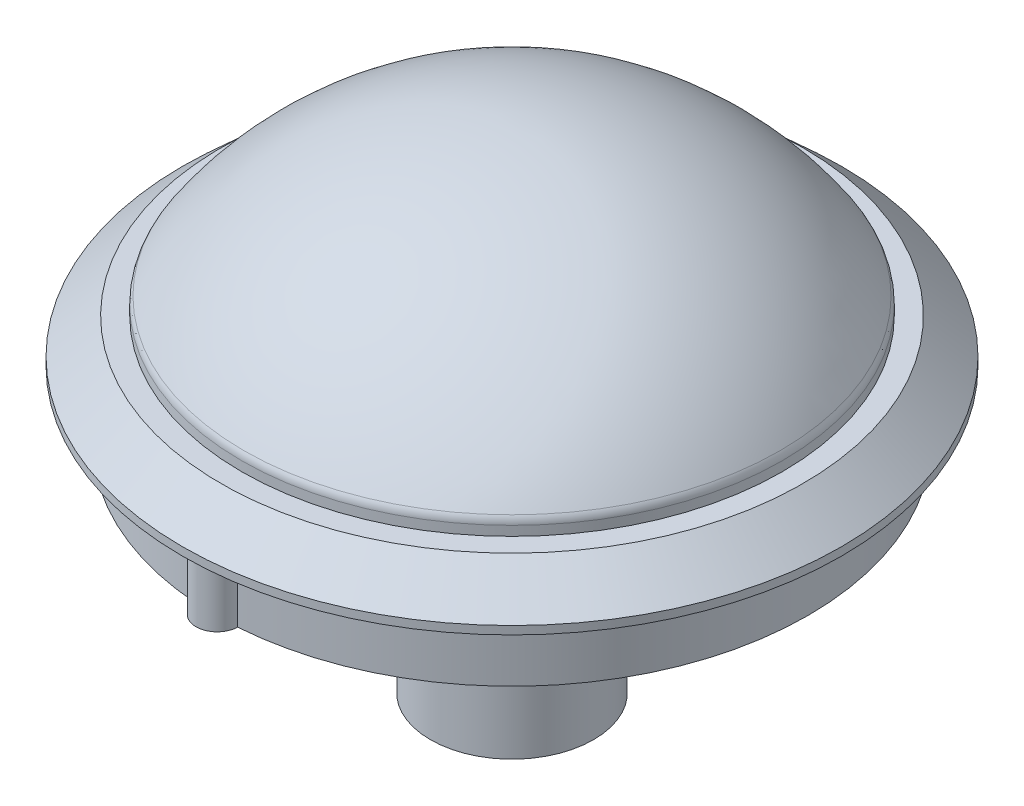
from build123d import *

# Parameters (mm, degrees)
BOSS_EXTRU_1_DEPTH = 10
ESQUISSE3_R        = 12
BOSS_EXTRU_2_DEPTH = 31.6
CONG_1_R           = 2


with BuildPart() as part:
    # Esquisse1 → Boss.-Extru.1 (new body)
    with BuildSketch(Plane(origin=(0, 0, 0), x_dir=(1, 0, 0), z_dir=(0, 1, 0))):
        with BuildLine():
            ThreePointArc((3.098704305, -43.439619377), (43.55, 0), (3.098704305, 43.439619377))
            ThreePointArc((3.098704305, 43.439619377), (0, 46.45), (-3.098704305, 43.439619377))
            ThreePointArc((-3.098704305, 43.439619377), (-43.55, 0), (-3.098704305, -43.439619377))
            ThreePointArc((-3.098704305, -43.439619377), (0, -46.45), (3.098704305, -43.439619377))
        make_face()
    extrude(amount=BOSS_EXTRU_1_DEPTH)

    # Esquisse2 → R_volution1 (revolve)
    with BuildSketch(Plane(origin=(0, 0, 0), x_dir=(0, 0, -1), z_dir=(1, 0, 0))):
        Polygon((39.65, 16.4), (42.775195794, 16.4), (48.45, 11.2), (48.45, 10), (0, 10), (0, 12), (39.65, 12), align=None)
    revolve(axis=Axis((0, -3.35540193, 0), (0, 1, 0)))

    # Esquisse3 → Boss.-Extru.2 (add)
    with BuildSketch(Plane.XZ):
        with Locations(Location((0, 0, 0), (0, 0, 90))):
            Circle(ESQUISSE3_R)
    extrude(amount=BOSS_EXTRU_2_DEPTH)

    # Esquisse4 → R_volution2 (revolve)
    with BuildSketch(Plane(origin=(0, 0, 0), x_dir=(0, 0, -1), z_dir=(1, 0, 0))):
        with BuildLine():
            Line((39.75, 18.4), (39.75, 12))
            Line((39.75, 12), (0, 12))
            Line((0, 12), (0, 40))
            ThreePointArc((0, 40), (22.619806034, 34.251205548), (39.75, 18.4))
        make_face()
    revolve(axis=Axis((0, 12, 0), (0, 1, 0)))

    # Cong_1
    cong_1_edges = [part.edges().sort_by_distance(p)[0] for p in [
        (0, 18.4, 39.75),
    ]]
    fillet(cong_1_edges, radius=CONG_1_R)


solid = part.part
